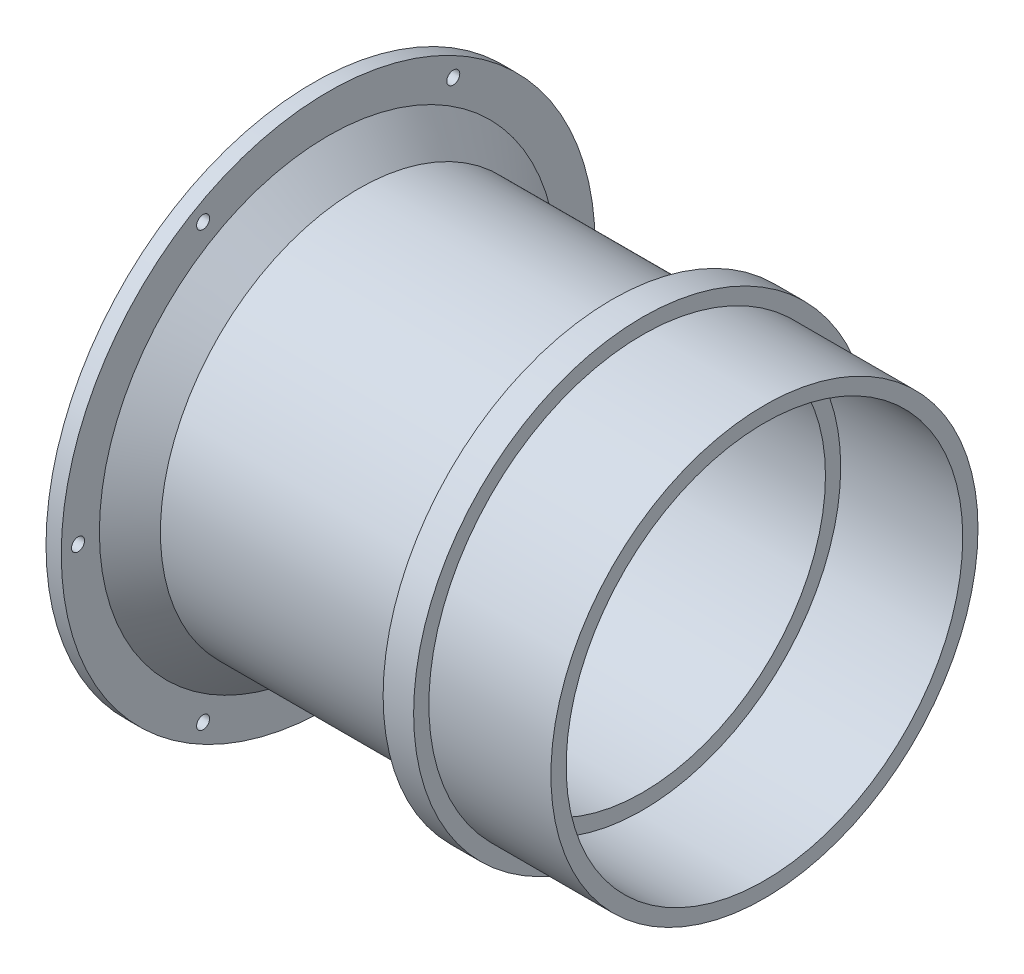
from build123d import *

# Parameters (mm, degrees)
F_6_32_TAPPED_HOLE1_D     = 2.7051
F_6_32_TAPPED_HOLE1_DEPTH = 11.176
CIRPATTERN1_COUNT         = 6
FILLET1_R                 = 0.508


with BuildPart() as part:
    # Sketch1 → Revolve1 (revolve)
    with BuildSketch(Plane.XY, mode=Mode.PRIVATE) as revolve1_sk:
        Polygon((0, 48.26), (0, 44.45), (6.35, 44.45), (6.35, 42.926), (7.1755, 42.926), (7.1755, 38.1), (73.3552, 38.1), (73.3552, 41.275), (98.7552, 41.275), (98.7552, 44.45), (73.3552, 44.45), (73.3552, 47.625), (67.0052, 47.625), (67.0052, 42.8625), (65.4177, 41.275), (14.3002, 41.275), (7.9502, 47.625), (7.9502, 55.5625), (4.7752, 55.5625), (4.7752, 48.26), align=None)
    revolve(revolve1_sk.sketch.rotate(Axis((0, 0, 0), (-1, 0, 0)), 90), axis=Axis((0, 0, 0), (-1, 0, 0)))

    # 6-32 Tapped Hole1
    with Locations(Plane.ZY.offset(-4.7752)):
        with Locations((-52.07, 0)):
            f_6_32_tapped_hole1 = Hole(F_6_32_TAPPED_HOLE1_D / 2, depth=F_6_32_TAPPED_HOLE1_DEPTH)

    # CirPattern1: 6-32 Tapped Hole1 ×6 about axis
    cirpattern1_axis = Axis((0, 0, 0), (1, 0, 0))
    for i in range(1, CIRPATTERN1_COUNT):
        add(f_6_32_tapped_hole1.rotate(cirpattern1_axis, i * 360 / CIRPATTERN1_COUNT), mode=Mode.SUBTRACT)

    # Fillet1
    fillet1_edges = [part.edges().sort_by_distance(p)[0] for p in [
        (0, 0, 48.26),
    ]]
    fillet(fillet1_edges, radius=FILLET1_R)


solid = part.part
